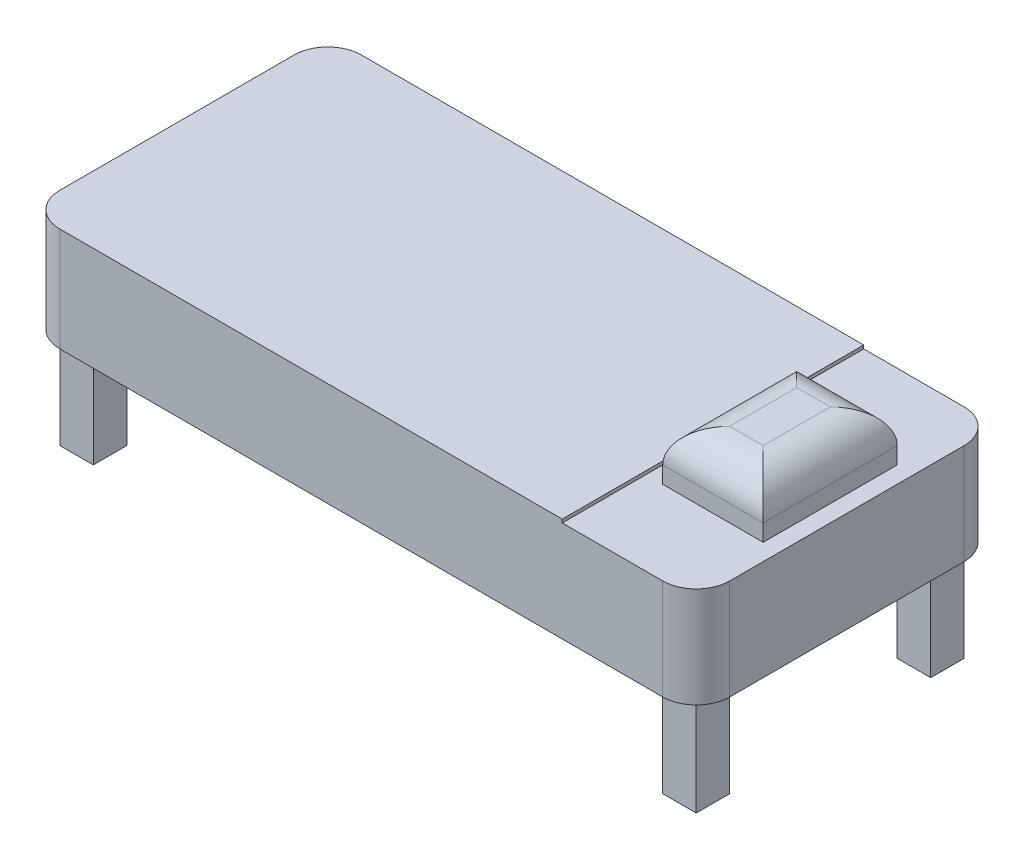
ISO-10303-21;
HEADER;
FILE_DESCRIPTION(('STEP AP214'),'2;1');
FILE_NAME('part.step','',(''),(''),'','','');
FILE_SCHEMA(('AUTOMOTIVE_DESIGN { 1 0 10303 214 1 1 1 1 }'));
ENDSEC;
DATA;
#1=APPLICATION_CONTEXT('core data for automotive mechanical design processes');
#2=APPLICATION_PROTOCOL_DEFINITION('international standard','automotive_design',2000,#1);
#3=PRODUCT_CONTEXT('',#1,'mechanical');
#4=PRODUCT('Part','Part','',(#3));
#5=PRODUCT_RELATED_PRODUCT_CATEGORY('part','',(#4));
#6=PRODUCT_DEFINITION_FORMATION('','',#4);
#7=PRODUCT_DEFINITION_CONTEXT('part definition',#1,'design');
#8=PRODUCT_DEFINITION('design','',#6,#7);
#9=PRODUCT_DEFINITION_SHAPE('','',#8);
#10=(LENGTH_UNIT() NAMED_UNIT(*) SI_UNIT(.MILLI.,.METRE.));
#11=(NAMED_UNIT(*) PLANE_ANGLE_UNIT() SI_UNIT($,.RADIAN.));
#12=(NAMED_UNIT(*) SI_UNIT($,.STERADIAN.) SOLID_ANGLE_UNIT());
#13=UNCERTAINTY_MEASURE_WITH_UNIT(LENGTH_MEASURE(1.E-05),#10,'distance_accuracy_value','');
#14=(GEOMETRIC_REPRESENTATION_CONTEXT(3) GLOBAL_UNCERTAINTY_ASSIGNED_CONTEXT((#13)) GLOBAL_UNIT_ASSIGNED_CONTEXT((#10,
#11,#12)) REPRESENTATION_CONTEXT('',''));
#15=CARTESIAN_POINT('',(0.,0.,0.));
#16=DIRECTION('',(0.,0.,1.));
#17=DIRECTION('',(1.,0.,0.));
#18=AXIS2_PLACEMENT_3D('',#15,#16,#17);
#19=CARTESIAN_POINT('',(0.,300.,0.));
#20=DIRECTION('',(0.,1.,0.));
#21=DIRECTION('',(0.,0.,1.));
#22=AXIS2_PLACEMENT_3D('',#19,#20,#21);
#23=PLANE('',#22);
#24=DIRECTION('',(0.,0.,-1.));
#25=VECTOR('',#24,1.);
#26=CARTESIAN_POINT('',(1000.,300.,450.));
#27=LINE('',#26,#25);
#28=CARTESIAN_POINT('',(1000.,300.,350.));
#29=VERTEX_POINT('',#28);
#30=CARTESIAN_POINT('',(1000.,300.,-350.));
#31=VERTEX_POINT('',#30);
#32=EDGE_CURVE('E338',#29,#31,#27,.T.);
#33=ORIENTED_EDGE('',*,*,#32,.T.);
#34=CARTESIAN_POINT('',(900.,300.,-350.));
#35=DIRECTION('',(0.,1.,0.));
#36=DIRECTION('',(0.,0.,1.));
#37=AXIS2_PLACEMENT_3D('',#34,#35,#36);
#38=CIRCLE('',#37,100.);
#39=CARTESIAN_POINT('',(900.,300.,-450.));
#40=VERTEX_POINT('',#39);
#41=EDGE_CURVE('E364',#31,#40,#38,.T.);
#42=ORIENTED_EDGE('',*,*,#41,.T.);
#43=DIRECTION('',(-1.,0.,0.));
#44=VECTOR('',#43,1.);
#45=CARTESIAN_POINT('',(1000.,300.,-450.));
#46=LINE('',#45,#44);
#47=CARTESIAN_POINT('',(600.,300.,-450.));
#48=VERTEX_POINT('',#47);
#49=EDGE_CURVE('E311',#40,#48,#46,.T.);
#50=ORIENTED_EDGE('',*,*,#49,.T.);
#51=DIRECTION('',(0.,0.,-1.));
#52=VECTOR('',#51,1.);
#53=CARTESIAN_POINT('',(600.,300.,-450.));
#54=LINE('',#53,#52);
#55=CARTESIAN_POINT('',(600.,300.,450.));
#56=VERTEX_POINT('',#55);
#57=EDGE_CURVE('E254',#56,#48,#54,.T.);
#58=ORIENTED_EDGE('',*,*,#57,.F.);
#59=DIRECTION('',(1.,0.,0.));
#60=VECTOR('',#59,1.);
#61=CARTESIAN_POINT('',(1000.,300.,450.));
#62=LINE('',#61,#60);
#63=CARTESIAN_POINT('',(900.,300.,450.));
#64=VERTEX_POINT('',#63);
#65=EDGE_CURVE('E295',#56,#64,#62,.T.);
#66=ORIENTED_EDGE('',*,*,#65,.T.);
#67=CARTESIAN_POINT('',(900.,300.,350.));
#68=DIRECTION('',(0.,1.,0.));
#69=DIRECTION('',(0.,0.,1.));
#70=AXIS2_PLACEMENT_3D('',#67,#68,#69);
#71=CIRCLE('',#70,100.);
#72=EDGE_CURVE('E366',#64,#29,#71,.T.);
#73=ORIENTED_EDGE('',*,*,#72,.T.);
#74=EDGE_LOOP('',(#33,#42,#50,#58,#66,#73));
#75=FACE_BOUND('',#74,.T.);
#76=DIRECTION('',(1.,0.,0.));
#77=VECTOR('',#76,1.);
#78=CARTESIAN_POINT('',(650.,300.,200.));
#79=LINE('',#78,#77);
#80=CARTESIAN_POINT('',(650.,300.,200.));
#81=VERTEX_POINT('',#80);
#82=CARTESIAN_POINT('',(950.,300.,200.));
#83=VERTEX_POINT('',#82);
#84=EDGE_CURVE('E248',#81,#83,#79,.T.);
#85=ORIENTED_EDGE('',*,*,#84,.F.);
#86=DIRECTION('',(0.,0.,1.));
#87=VECTOR('',#86,1.);
#88=CARTESIAN_POINT('',(650.,300.,-200.));
#89=LINE('',#88,#87);
#90=CARTESIAN_POINT('',(650.,300.,-200.));
#91=VERTEX_POINT('',#90);
#92=EDGE_CURVE('E258',#91,#81,#89,.T.);
#93=ORIENTED_EDGE('',*,*,#92,.F.);
#94=DIRECTION('',(-1.,0.,0.));
#95=VECTOR('',#94,1.);
#96=CARTESIAN_POINT('',(650.,300.,-200.));
#97=LINE('',#96,#95);
#98=CARTESIAN_POINT('',(950.,300.,-200.));
#99=VERTEX_POINT('',#98);
#100=EDGE_CURVE('E270',#99,#91,#97,.T.);
#101=ORIENTED_EDGE('',*,*,#100,.F.);
#102=DIRECTION('',(0.,0.,-1.));
#103=VECTOR('',#102,1.);
#104=CARTESIAN_POINT('',(950.,300.,-200.));
#105=LINE('',#104,#103);
#106=EDGE_CURVE('E268',#83,#99,#105,.T.);
#107=ORIENTED_EDGE('',*,*,#106,.F.);
#108=EDGE_LOOP('',(#85,#93,#101,#107));
#109=FACE_BOUND('',#108,.T.);
#110=ADVANCED_FACE('F34',(#75,#109),#23,.T.);
#111=CARTESIAN_POINT('',(0.,0.,0.));
#112=DIRECTION('',(0.,1.,0.));
#113=DIRECTION('',(0.,0.,1.));
#114=AXIS2_PLACEMENT_3D('',#111,#112,#113);
#115=PLANE('',#114);
#116=DIRECTION('',(0.,0.,1.));
#117=VECTOR('',#116,1.);
#118=CARTESIAN_POINT('',(-850.,0.,400.));
#119=LINE('',#118,#117);
#120=CARTESIAN_POINT('',(-850.,0.,300.));
#121=VERTEX_POINT('',#120);
#122=CARTESIAN_POINT('',(-850.,0.,400.));
#123=VERTEX_POINT('',#122);
#124=EDGE_CURVE('E567',#121,#123,#119,.T.);
#125=ORIENTED_EDGE('',*,*,#124,.F.);
#126=DIRECTION('',(1.,0.,0.));
#127=VECTOR('',#126,1.);
#128=CARTESIAN_POINT('',(-950.,0.,300.));
#129=LINE('',#128,#127);
#130=CARTESIAN_POINT('',(-950.,0.,300.));
#131=VERTEX_POINT('',#130);
#132=EDGE_CURVE('E583',#131,#121,#129,.T.);
#133=ORIENTED_EDGE('',*,*,#132,.F.);
#134=DIRECTION('',(0.,0.,-1.));
#135=VECTOR('',#134,1.);
#136=CARTESIAN_POINT('',(-950.,0.,400.));
#137=LINE('',#136,#135);
#138=CARTESIAN_POINT('',(-950.,0.,400.));
#139=VERTEX_POINT('',#138);
#140=EDGE_CURVE('E566',#139,#131,#137,.T.);
#141=ORIENTED_EDGE('',*,*,#140,.F.);
#142=DIRECTION('',(-1.,0.,0.));
#143=VECTOR('',#142,1.);
#144=CARTESIAN_POINT('',(-950.,0.,400.));
#145=LINE('',#144,#143);
#146=EDGE_CURVE('E560',#123,#139,#145,.T.);
#147=ORIENTED_EDGE('',*,*,#146,.F.);
#148=EDGE_LOOP('',(#125,#133,#141,#147));
#149=FACE_BOUND('',#148,.T.);
#150=DIRECTION('',(-1.,0.,0.));
#151=VECTOR('',#150,1.);
#152=CARTESIAN_POINT('',(1000.,0.,-450.));
#153=LINE('',#152,#151);
#154=CARTESIAN_POINT('',(900.,0.,-450.));
#155=VERTEX_POINT('',#154);
#156=CARTESIAN_POINT('',(-900.,0.,-450.));
#157=VERTEX_POINT('',#156);
#158=EDGE_CURVE('E351',#155,#157,#153,.T.);
#159=ORIENTED_EDGE('',*,*,#158,.F.);
#160=CARTESIAN_POINT('',(900.,0.,-350.));
#161=DIRECTION('',(0.,1.,0.));
#162=DIRECTION('',(0.,0.,1.));
#163=AXIS2_PLACEMENT_3D('',#160,#161,#162);
#164=CIRCLE('',#163,100.);
#165=CARTESIAN_POINT('',(1000.,0.,-350.));
#166=VERTEX_POINT('',#165);
#167=EDGE_CURVE('E402',#155,#166,#164,.F.);
#168=ORIENTED_EDGE('',*,*,#167,.T.);
#169=DIRECTION('',(0.,0.,-1.));
#170=VECTOR('',#169,1.);
#171=CARTESIAN_POINT('',(1000.,0.,450.));
#172=LINE('',#171,#170);
#173=CARTESIAN_POINT('',(1000.,0.,350.));
#174=VERTEX_POINT('',#173);
#175=EDGE_CURVE('E349',#174,#166,#172,.T.);
#176=ORIENTED_EDGE('',*,*,#175,.F.);
#177=CARTESIAN_POINT('',(900.,0.,350.));
#178=DIRECTION('',(0.,1.,0.));
#179=DIRECTION('',(0.,0.,1.));
#180=AXIS2_PLACEMENT_3D('',#177,#178,#179);
#181=CIRCLE('',#180,100.);
#182=CARTESIAN_POINT('',(900.,0.,450.));
#183=VERTEX_POINT('',#182);
#184=EDGE_CURVE('E400',#174,#183,#181,.F.);
#185=ORIENTED_EDGE('',*,*,#184,.T.);
#186=DIRECTION('',(1.,0.,0.));
#187=VECTOR('',#186,1.);
#188=CARTESIAN_POINT('',(1000.,0.,450.));
#189=LINE('',#188,#187);
#190=CARTESIAN_POINT('',(-900.,0.,450.));
#191=VERTEX_POINT('',#190);
#192=EDGE_CURVE('E345',#191,#183,#189,.T.);
#193=ORIENTED_EDGE('',*,*,#192,.F.);
#194=CARTESIAN_POINT('',(-900.,0.,350.));
#195=DIRECTION('',(0.,1.,0.));
#196=DIRECTION('',(0.,0.,1.));
#197=AXIS2_PLACEMENT_3D('',#194,#195,#196);
#198=CIRCLE('',#197,100.);
#199=CARTESIAN_POINT('',(-1000.,0.,350.));
#200=VERTEX_POINT('',#199);
#201=EDGE_CURVE('E397',#191,#200,#198,.F.);
#202=ORIENTED_EDGE('',*,*,#201,.T.);
#203=DIRECTION('',(0.,0.,1.));
#204=VECTOR('',#203,1.);
#205=CARTESIAN_POINT('',(-1000.,0.,450.));
#206=LINE('',#205,#204);
#207=CARTESIAN_POINT('',(-1000.,0.,-350.));
#208=VERTEX_POINT('',#207);
#209=EDGE_CURVE('E343',#208,#200,#206,.T.);
#210=ORIENTED_EDGE('',*,*,#209,.F.);
#211=CARTESIAN_POINT('',(-900.,0.,-350.));
#212=DIRECTION('',(0.,1.,0.));
#213=DIRECTION('',(0.,0.,1.));
#214=AXIS2_PLACEMENT_3D('',#211,#212,#213);
#215=CIRCLE('',#214,100.);
#216=EDGE_CURVE('E395',#208,#157,#215,.F.);
#217=ORIENTED_EDGE('',*,*,#216,.T.);
#218=EDGE_LOOP('',(#159,#168,#176,#185,#193,#202,#210,#217));
#219=FACE_BOUND('',#218,.T.);
#220=DIRECTION('',(1.,0.,0.));
#221=VECTOR('',#220,1.);
#222=CARTESIAN_POINT('',(-950.,0.,-300.));
#223=LINE('',#222,#221);
#224=CARTESIAN_POINT('',(-950.,0.,-300.));
#225=VERTEX_POINT('',#224);
#226=CARTESIAN_POINT('',(-850.,0.,-300.));
#227=VERTEX_POINT('',#226);
#228=EDGE_CURVE('E612',#225,#227,#223,.T.);
#229=ORIENTED_EDGE('',*,*,#228,.T.);
#230=DIRECTION('',(0.,0.,-1.));
#231=VECTOR('',#230,1.);
#232=CARTESIAN_POINT('',(-850.,0.,-400.));
#233=LINE('',#232,#231);
#234=CARTESIAN_POINT('',(-850.,0.,-400.));
#235=VERTEX_POINT('',#234);
#236=EDGE_CURVE('E615',#227,#235,#233,.T.);
#237=ORIENTED_EDGE('',*,*,#236,.T.);
#238=DIRECTION('',(-1.,0.,0.));
#239=VECTOR('',#238,1.);
#240=CARTESIAN_POINT('',(-950.,0.,-400.));
#241=LINE('',#240,#239);
#242=CARTESIAN_POINT('',(-950.,0.,-400.));
#243=VERTEX_POINT('',#242);
#244=EDGE_CURVE('E605',#235,#243,#241,.T.);
#245=ORIENTED_EDGE('',*,*,#244,.T.);
#246=DIRECTION('',(0.,0.,1.));
#247=VECTOR('',#246,1.);
#248=CARTESIAN_POINT('',(-950.,0.,-400.));
#249=LINE('',#248,#247);
#250=EDGE_CURVE('E609',#243,#225,#249,.T.);
#251=ORIENTED_EDGE('',*,*,#250,.T.);
#252=EDGE_LOOP('',(#229,#237,#245,#251));
#253=FACE_BOUND('',#252,.T.);
#254=DIRECTION('',(-1.,0.,0.));
#255=VECTOR('',#254,1.);
#256=CARTESIAN_POINT('',(950.,0.,300.));
#257=LINE('',#256,#255);
#258=CARTESIAN_POINT('',(950.,0.,300.));
#259=VERTEX_POINT('',#258);
#260=CARTESIAN_POINT('',(850.,0.,300.));
#261=VERTEX_POINT('',#260);
#262=EDGE_CURVE('E645',#259,#261,#257,.T.);
#263=ORIENTED_EDGE('',*,*,#262,.T.);
#264=DIRECTION('',(0.,0.,1.));
#265=VECTOR('',#264,1.);
#266=CARTESIAN_POINT('',(850.,0.,400.));
#267=LINE('',#266,#265);
#268=CARTESIAN_POINT('',(850.,0.,400.));
#269=VERTEX_POINT('',#268);
#270=EDGE_CURVE('E648',#261,#269,#267,.T.);
#271=ORIENTED_EDGE('',*,*,#270,.T.);
#272=DIRECTION('',(1.,0.,0.));
#273=VECTOR('',#272,1.);
#274=CARTESIAN_POINT('',(950.,0.,400.));
#275=LINE('',#274,#273);
#276=CARTESIAN_POINT('',(950.,0.,400.));
#277=VERTEX_POINT('',#276);
#278=EDGE_CURVE('E638',#269,#277,#275,.T.);
#279=ORIENTED_EDGE('',*,*,#278,.T.);
#280=DIRECTION('',(0.,0.,-1.));
#281=VECTOR('',#280,1.);
#282=CARTESIAN_POINT('',(950.,0.,400.));
#283=LINE('',#282,#281);
#284=EDGE_CURVE('E642',#277,#259,#283,.T.);
#285=ORIENTED_EDGE('',*,*,#284,.T.);
#286=EDGE_LOOP('',(#263,#271,#279,#285));
#287=FACE_BOUND('',#286,.T.);
#288=DIRECTION('',(0.,0.,-1.));
#289=VECTOR('',#288,1.);
#290=CARTESIAN_POINT('',(850.,0.,-400.));
#291=LINE('',#290,#289);
#292=CARTESIAN_POINT('',(850.,0.,-300.));
#293=VERTEX_POINT('',#292);
#294=CARTESIAN_POINT('',(850.,0.,-400.));
#295=VERTEX_POINT('',#294);
#296=EDGE_CURVE('E305',#293,#295,#291,.T.);
#297=ORIENTED_EDGE('',*,*,#296,.F.);
#298=DIRECTION('',(-1.,0.,0.));
#299=VECTOR('',#298,1.);
#300=CARTESIAN_POINT('',(950.,0.,-300.));
#301=LINE('',#300,#299);
#302=CARTESIAN_POINT('',(950.,0.,-300.));
#303=VERTEX_POINT('',#302);
#304=EDGE_CURVE('E674',#303,#293,#301,.T.);
#305=ORIENTED_EDGE('',*,*,#304,.F.);
#306=DIRECTION('',(0.,0.,1.));
#307=VECTOR('',#306,1.);
#308=CARTESIAN_POINT('',(950.,0.,-400.));
#309=LINE('',#308,#307);
#310=CARTESIAN_POINT('',(950.,0.,-400.));
#311=VERTEX_POINT('',#310);
#312=EDGE_CURVE('E677',#311,#303,#309,.T.);
#313=ORIENTED_EDGE('',*,*,#312,.F.);
#314=DIRECTION('',(1.,0.,0.));
#315=VECTOR('',#314,1.);
#316=CARTESIAN_POINT('',(950.,0.,-400.));
#317=LINE('',#316,#315);
#318=EDGE_CURVE('E680',#295,#311,#317,.T.);
#319=ORIENTED_EDGE('',*,*,#318,.F.);
#320=EDGE_LOOP('',(#297,#305,#313,#319));
#321=FACE_BOUND('',#320,.T.);
#322=ADVANCED_FACE('F393',(#149,#219,#253,#287,#321),#115,.F.);
#323=CARTESIAN_POINT('',(-1000.,300.,450.));
#324=DIRECTION('',(1.,0.,0.));
#325=DIRECTION('',(0.,0.,-1.));
#326=AXIS2_PLACEMENT_3D('',#323,#324,#325);
#327=PLANE('',#326);
#328=ORIENTED_EDGE('',*,*,#209,.T.);
#329=DIRECTION('',(0.,-1.,0.));
#330=VECTOR('',#329,1.);
#331=CARTESIAN_POINT('',(-1000.,300.,350.));
#332=LINE('',#331,#330);
#333=CARTESIAN_POINT('',(-1000.,310.,350.));
#334=VERTEX_POINT('',#333);
#335=EDGE_CURVE('E49',#200,#334,#332,.F.);
#336=ORIENTED_EDGE('',*,*,#335,.T.);
#337=DIRECTION('',(0.,0.,1.));
#338=VECTOR('',#337,1.);
#339=CARTESIAN_POINT('',(-1000.,310.,-450.));
#340=LINE('',#339,#338);
#341=CARTESIAN_POINT('',(-1000.,310.,-350.));
#342=VERTEX_POINT('',#341);
#343=EDGE_CURVE('E278',#342,#334,#340,.T.);
#344=ORIENTED_EDGE('',*,*,#343,.F.);
#345=DIRECTION('',(0.,-1.,0.));
#346=VECTOR('',#345,1.);
#347=CARTESIAN_POINT('',(-1000.,300.,-350.));
#348=LINE('',#347,#346);
#349=EDGE_CURVE('E385',#342,#208,#348,.T.);
#350=ORIENTED_EDGE('',*,*,#349,.T.);
#351=EDGE_LOOP('',(#328,#336,#344,#350));
#352=FACE_BOUND('',#351,.T.);
#353=ADVANCED_FACE('F390',(#352),#327,.F.);
#354=CARTESIAN_POINT('',(1000.,300.,450.));
#355=DIRECTION('',(0.,0.,-1.));
#356=DIRECTION('',(-1.,0.,0.));
#357=AXIS2_PLACEMENT_3D('',#354,#355,#356);
#358=PLANE('',#357);
#359=ORIENTED_EDGE('',*,*,#192,.T.);
#360=DIRECTION('',(0.,-1.,0.));
#361=VECTOR('',#360,1.);
#362=CARTESIAN_POINT('',(900.,300.,450.));
#363=LINE('',#362,#361);
#364=EDGE_CURVE('E379',#183,#64,#363,.F.);
#365=ORIENTED_EDGE('',*,*,#364,.T.);
#366=ORIENTED_EDGE('',*,*,#65,.F.);
#367=DIRECTION('',(0.,-1.,0.));
#368=VECTOR('',#367,1.);
#369=CARTESIAN_POINT('',(600.,310.,450.));
#370=LINE('',#369,#368);
#371=CARTESIAN_POINT('',(600.,310.,450.));
#372=VERTEX_POINT('',#371);
#373=EDGE_CURVE('E300',#372,#56,#370,.T.);
#374=ORIENTED_EDGE('',*,*,#373,.F.);
#375=DIRECTION('',(1.,0.,0.));
#376=VECTOR('',#375,1.);
#377=CARTESIAN_POINT('',(-1000.,310.,450.));
#378=LINE('',#377,#376);
#379=CARTESIAN_POINT('',(-900.,310.,450.));
#380=VERTEX_POINT('',#379);
#381=EDGE_CURVE('E280',#380,#372,#378,.T.);
#382=ORIENTED_EDGE('',*,*,#381,.F.);
#383=DIRECTION('',(0.,-1.,0.));
#384=VECTOR('',#383,1.);
#385=CARTESIAN_POINT('',(-900.,300.,450.));
#386=LINE('',#385,#384);
#387=EDGE_CURVE('E376',#380,#191,#386,.T.);
#388=ORIENTED_EDGE('',*,*,#387,.T.);
#389=EDGE_LOOP('',(#359,#365,#366,#374,#382,#388));
#390=FACE_BOUND('',#389,.T.);
#391=ADVANCED_FACE('F436',(#390),#358,.F.);
#392=CARTESIAN_POINT('',(1000.,300.,450.));
#393=DIRECTION('',(-1.,0.,0.));
#394=DIRECTION('',(0.,0.,1.));
#395=AXIS2_PLACEMENT_3D('',#392,#393,#394);
#396=PLANE('',#395);
#397=ORIENTED_EDGE('',*,*,#175,.T.);
#398=DIRECTION('',(0.,-1.,0.));
#399=VECTOR('',#398,1.);
#400=CARTESIAN_POINT('',(1000.,300.,-350.));
#401=LINE('',#400,#399);
#402=EDGE_CURVE('E374',#166,#31,#401,.F.);
#403=ORIENTED_EDGE('',*,*,#402,.T.);
#404=ORIENTED_EDGE('',*,*,#32,.F.);
#405=DIRECTION('',(0.,-1.,0.));
#406=VECTOR('',#405,1.);
#407=CARTESIAN_POINT('',(1000.,300.,350.));
#408=LINE('',#407,#406);
#409=EDGE_CURVE('E407',#29,#174,#408,.T.);
#410=ORIENTED_EDGE('',*,*,#409,.T.);
#411=EDGE_LOOP('',(#397,#403,#404,#410));
#412=FACE_BOUND('',#411,.T.);
#413=ADVANCED_FACE('F408',(#412),#396,.F.);
#414=CARTESIAN_POINT('',(1000.,300.,-450.));
#415=DIRECTION('',(0.,0.,1.));
#416=DIRECTION('',(1.,0.,0.));
#417=AXIS2_PLACEMENT_3D('',#414,#415,#416);
#418=PLANE('',#417);
#419=ORIENTED_EDGE('',*,*,#49,.F.);
#420=DIRECTION('',(0.,-1.,0.));
#421=VECTOR('',#420,1.);
#422=CARTESIAN_POINT('',(900.,300.,-450.));
#423=LINE('',#422,#421);
#424=EDGE_CURVE('E375',#40,#155,#423,.T.);
#425=ORIENTED_EDGE('',*,*,#424,.T.);
#426=ORIENTED_EDGE('',*,*,#158,.T.);
#427=DIRECTION('',(0.,-1.,0.));
#428=VECTOR('',#427,1.);
#429=CARTESIAN_POINT('',(-900.,300.,-450.));
#430=LINE('',#429,#428);
#431=CARTESIAN_POINT('',(-900.,310.,-450.));
#432=VERTEX_POINT('',#431);
#433=EDGE_CURVE('E326',#157,#432,#430,.F.);
#434=ORIENTED_EDGE('',*,*,#433,.T.);
#435=DIRECTION('',(-1.,0.,0.));
#436=VECTOR('',#435,1.);
#437=CARTESIAN_POINT('',(-1000.,310.,-450.));
#438=LINE('',#437,#436);
#439=CARTESIAN_POINT('',(600.,310.,-450.));
#440=VERTEX_POINT('',#439);
#441=EDGE_CURVE('E284',#440,#432,#438,.T.);
#442=ORIENTED_EDGE('',*,*,#441,.F.);
#443=DIRECTION('',(0.,-1.,0.));
#444=VECTOR('',#443,1.);
#445=CARTESIAN_POINT('',(600.,310.,-450.));
#446=LINE('',#445,#444);
#447=EDGE_CURVE('E286',#440,#48,#446,.T.);
#448=ORIENTED_EDGE('',*,*,#447,.T.);
#449=EDGE_LOOP('',(#419,#425,#426,#434,#442,#448));
#450=FACE_BOUND('',#449,.T.);
#451=ADVANCED_FACE('F410',(#450),#418,.F.);
#452=CARTESIAN_POINT('',(-850.,-300.,400.));
#453=DIRECTION('',(-1.,0.,0.));
#454=DIRECTION('',(0.,0.,1.));
#455=AXIS2_PLACEMENT_3D('',#452,#453,#454);
#456=PLANE('',#455);
#457=ORIENTED_EDGE('',*,*,#124,.T.);
#458=DIRECTION('',(0.,1.,0.));
#459=VECTOR('',#458,1.);
#460=CARTESIAN_POINT('',(-850.,-300.,400.));
#461=LINE('',#460,#459);
#462=CARTESIAN_POINT('',(-850.,-300.,400.));
#463=VERTEX_POINT('',#462);
#464=EDGE_CURVE('E346',#463,#123,#461,.T.);
#465=ORIENTED_EDGE('',*,*,#464,.F.);
#466=DIRECTION('',(0.,0.,1.));
#467=VECTOR('',#466,1.);
#468=CARTESIAN_POINT('',(-850.,-300.,400.));
#469=LINE('',#468,#467);
#470=CARTESIAN_POINT('',(-850.,-300.,300.));
#471=VERTEX_POINT('',#470);
#472=EDGE_CURVE('E586',#471,#463,#469,.T.);
#473=ORIENTED_EDGE('',*,*,#472,.F.);
#474=DIRECTION('',(0.,1.,0.));
#475=VECTOR('',#474,1.);
#476=CARTESIAN_POINT('',(-850.,-300.,300.));
#477=LINE('',#476,#475);
#478=EDGE_CURVE('E576',#471,#121,#477,.T.);
#479=ORIENTED_EDGE('',*,*,#478,.T.);
#480=EDGE_LOOP('',(#457,#465,#473,#479));
#481=FACE_BOUND('',#480,.T.);
#482=ADVANCED_FACE('F429',(#481),#456,.F.);
#483=CARTESIAN_POINT('',(-950.,-300.,400.));
#484=DIRECTION('',(0.,0.,-1.));
#485=DIRECTION('',(-1.,0.,0.));
#486=AXIS2_PLACEMENT_3D('',#483,#484,#485);
#487=PLANE('',#486);
#488=ORIENTED_EDGE('',*,*,#146,.T.);
#489=DIRECTION('',(0.,1.,0.));
#490=VECTOR('',#489,1.);
#491=CARTESIAN_POINT('',(-950.,-300.,400.));
#492=LINE('',#491,#490);
#493=CARTESIAN_POINT('',(-950.,-300.,400.));
#494=VERTEX_POINT('',#493);
#495=EDGE_CURVE('E562',#494,#139,#492,.T.);
#496=ORIENTED_EDGE('',*,*,#495,.F.);
#497=DIRECTION('',(-1.,0.,0.));
#498=VECTOR('',#497,1.);
#499=CARTESIAN_POINT('',(-950.,-300.,400.));
#500=LINE('',#499,#498);
#501=EDGE_CURVE('E592',#463,#494,#500,.T.);
#502=ORIENTED_EDGE('',*,*,#501,.F.);
#503=ORIENTED_EDGE('',*,*,#464,.T.);
#504=EDGE_LOOP('',(#488,#496,#502,#503));
#505=FACE_BOUND('',#504,.T.);
#506=ADVANCED_FACE('F549',(#505),#487,.F.);
#507=CARTESIAN_POINT('',(-950.,-300.,400.));
#508=DIRECTION('',(1.,0.,0.));
#509=DIRECTION('',(0.,0.,-1.));
#510=AXIS2_PLACEMENT_3D('',#507,#508,#509);
#511=PLANE('',#510);
#512=ORIENTED_EDGE('',*,*,#140,.T.);
#513=DIRECTION('',(0.,1.,0.));
#514=VECTOR('',#513,1.);
#515=CARTESIAN_POINT('',(-950.,-300.,300.));
#516=LINE('',#515,#514);
#517=CARTESIAN_POINT('',(-950.,-300.,300.));
#518=VERTEX_POINT('',#517);
#519=EDGE_CURVE('E573',#518,#131,#516,.T.);
#520=ORIENTED_EDGE('',*,*,#519,.F.);
#521=DIRECTION('',(0.,0.,-1.));
#522=VECTOR('',#521,1.);
#523=CARTESIAN_POINT('',(-950.,-300.,400.));
#524=LINE('',#523,#522);
#525=EDGE_CURVE('E572',#494,#518,#524,.T.);
#526=ORIENTED_EDGE('',*,*,#525,.F.);
#527=ORIENTED_EDGE('',*,*,#495,.T.);
#528=EDGE_LOOP('',(#512,#520,#526,#527));
#529=FACE_BOUND('',#528,.T.);
#530=ADVANCED_FACE('F546',(#529),#511,.F.);
#531=CARTESIAN_POINT('',(-950.,-300.,300.));
#532=DIRECTION('',(0.,0.,1.));
#533=DIRECTION('',(1.,0.,0.));
#534=AXIS2_PLACEMENT_3D('',#531,#532,#533);
#535=PLANE('',#534);
#536=ORIENTED_EDGE('',*,*,#132,.T.);
#537=ORIENTED_EDGE('',*,*,#478,.F.);
#538=DIRECTION('',(1.,0.,0.));
#539=VECTOR('',#538,1.);
#540=CARTESIAN_POINT('',(-950.,-300.,300.));
#541=LINE('',#540,#539);
#542=EDGE_CURVE('E582',#518,#471,#541,.T.);
#543=ORIENTED_EDGE('',*,*,#542,.F.);
#544=ORIENTED_EDGE('',*,*,#519,.T.);
#545=EDGE_LOOP('',(#536,#537,#543,#544));
#546=FACE_BOUND('',#545,.T.);
#547=ADVANCED_FACE('F542',(#546),#535,.F.);
#548=CARTESIAN_POINT('',(0.,-300.,0.));
#549=DIRECTION('',(0.,-1.,0.));
#550=DIRECTION('',(0.,0.,-1.));
#551=AXIS2_PLACEMENT_3D('',#548,#549,#550);
#552=PLANE('',#551);
#553=ORIENTED_EDGE('',*,*,#472,.T.);
#554=ORIENTED_EDGE('',*,*,#501,.T.);
#555=ORIENTED_EDGE('',*,*,#525,.T.);
#556=ORIENTED_EDGE('',*,*,#542,.T.);
#557=EDGE_LOOP('',(#553,#554,#555,#556));
#558=FACE_BOUND('',#557,.T.);
#559=ADVANCED_FACE('F538',(#558),#552,.T.);
#560=CARTESIAN_POINT('',(-850.,-300.,-400.));
#561=DIRECTION('',(1.,0.,0.));
#562=DIRECTION('',(0.,0.,-1.));
#563=AXIS2_PLACEMENT_3D('',#560,#561,#562);
#564=PLANE('',#563);
#565=ORIENTED_EDGE('',*,*,#236,.F.);
#566=DIRECTION('',(0.,1.,0.));
#567=VECTOR('',#566,1.);
#568=CARTESIAN_POINT('',(-850.,-300.,-300.));
#569=LINE('',#568,#567);
#570=CARTESIAN_POINT('',(-850.,-300.,-300.));
#571=VERTEX_POINT('',#570);
#572=EDGE_CURVE('E589',#571,#227,#569,.T.);
#573=ORIENTED_EDGE('',*,*,#572,.F.);
#574=DIRECTION('',(0.,0.,-1.));
#575=VECTOR('',#574,1.);
#576=CARTESIAN_POINT('',(-850.,-300.,-400.));
#577=LINE('',#576,#575);
#578=CARTESIAN_POINT('',(-850.,-300.,-400.));
#579=VERTEX_POINT('',#578);
#580=EDGE_CURVE('E608',#571,#579,#577,.T.);
#581=ORIENTED_EDGE('',*,*,#580,.T.);
#582=DIRECTION('',(0.,1.,0.));
#583=VECTOR('',#582,1.);
#584=CARTESIAN_POINT('',(-850.,-300.,-400.));
#585=LINE('',#584,#583);
#586=EDGE_CURVE('E602',#579,#235,#585,.T.);
#587=ORIENTED_EDGE('',*,*,#586,.T.);
#588=EDGE_LOOP('',(#565,#573,#581,#587));
#589=FACE_BOUND('',#588,.T.);
#590=ADVANCED_FACE('F534',(#589),#564,.T.);
#591=CARTESIAN_POINT('',(-950.,-300.,-300.));
#592=DIRECTION('',(0.,0.,1.));
#593=DIRECTION('',(1.,0.,0.));
#594=AXIS2_PLACEMENT_3D('',#591,#592,#593);
#595=PLANE('',#594);
#596=ORIENTED_EDGE('',*,*,#228,.F.);
#597=DIRECTION('',(0.,1.,0.));
#598=VECTOR('',#597,1.);
#599=CARTESIAN_POINT('',(-950.,-300.,-300.));
#600=LINE('',#599,#598);
#601=CARTESIAN_POINT('',(-950.,-300.,-300.));
#602=VERTEX_POINT('',#601);
#603=EDGE_CURVE('E597',#602,#225,#600,.T.);
#604=ORIENTED_EDGE('',*,*,#603,.F.);
#605=DIRECTION('',(1.,0.,0.));
#606=VECTOR('',#605,1.);
#607=CARTESIAN_POINT('',(-950.,-300.,-300.));
#608=LINE('',#607,#606);
#609=EDGE_CURVE('E624',#602,#571,#608,.T.);
#610=ORIENTED_EDGE('',*,*,#609,.T.);
#611=ORIENTED_EDGE('',*,*,#572,.T.);
#612=EDGE_LOOP('',(#596,#604,#610,#611));
#613=FACE_BOUND('',#612,.T.);
#614=ADVANCED_FACE('F530',(#613),#595,.T.);
#615=CARTESIAN_POINT('',(-950.,-300.,-400.));
#616=DIRECTION('',(-1.,0.,0.));
#617=DIRECTION('',(0.,0.,1.));
#618=AXIS2_PLACEMENT_3D('',#615,#616,#617);
#619=PLANE('',#618);
#620=ORIENTED_EDGE('',*,*,#250,.F.);
#621=DIRECTION('',(0.,1.,0.));
#622=VECTOR('',#621,1.);
#623=CARTESIAN_POINT('',(-950.,-300.,-400.));
#624=LINE('',#623,#622);
#625=CARTESIAN_POINT('',(-950.,-300.,-400.));
#626=VERTEX_POINT('',#625);
#627=EDGE_CURVE('E599',#626,#243,#624,.T.);
#628=ORIENTED_EDGE('',*,*,#627,.F.);
#629=DIRECTION('',(0.,0.,1.));
#630=VECTOR('',#629,1.);
#631=CARTESIAN_POINT('',(-950.,-300.,-400.));
#632=LINE('',#631,#630);
#633=EDGE_CURVE('E621',#626,#602,#632,.T.);
#634=ORIENTED_EDGE('',*,*,#633,.T.);
#635=ORIENTED_EDGE('',*,*,#603,.T.);
#636=EDGE_LOOP('',(#620,#628,#634,#635));
#637=FACE_BOUND('',#636,.T.);
#638=ADVANCED_FACE('F526',(#637),#619,.T.);
#639=CARTESIAN_POINT('',(-950.,-300.,-400.));
#640=DIRECTION('',(0.,0.,-1.));
#641=DIRECTION('',(-1.,0.,0.));
#642=AXIS2_PLACEMENT_3D('',#639,#640,#641);
#643=PLANE('',#642);
#644=ORIENTED_EDGE('',*,*,#244,.F.);
#645=ORIENTED_EDGE('',*,*,#586,.F.);
#646=DIRECTION('',(-1.,0.,0.));
#647=VECTOR('',#646,1.);
#648=CARTESIAN_POINT('',(-950.,-300.,-400.));
#649=LINE('',#648,#647);
#650=EDGE_CURVE('E604',#579,#626,#649,.T.);
#651=ORIENTED_EDGE('',*,*,#650,.T.);
#652=ORIENTED_EDGE('',*,*,#627,.T.);
#653=EDGE_LOOP('',(#644,#645,#651,#652));
#654=FACE_BOUND('',#653,.T.);
#655=ADVANCED_FACE('F522',(#654),#643,.T.);
#656=CARTESIAN_POINT('',(0.,-300.,0.));
#657=DIRECTION('',(0.,-1.,0.));
#658=DIRECTION('',(0.,0.,1.));
#659=AXIS2_PLACEMENT_3D('',#656,#657,#658);
#660=PLANE('',#659);
#661=ORIENTED_EDGE('',*,*,#580,.F.);
#662=ORIENTED_EDGE('',*,*,#609,.F.);
#663=ORIENTED_EDGE('',*,*,#633,.F.);
#664=ORIENTED_EDGE('',*,*,#650,.F.);
#665=EDGE_LOOP('',(#661,#662,#663,#664));
#666=FACE_BOUND('',#665,.T.);
#667=ADVANCED_FACE('F518',(#666),#660,.T.);
#668=CARTESIAN_POINT('',(850.,-300.,400.));
#669=DIRECTION('',(-1.,0.,0.));
#670=DIRECTION('',(0.,0.,1.));
#671=AXIS2_PLACEMENT_3D('',#668,#669,#670);
#672=PLANE('',#671);
#673=ORIENTED_EDGE('',*,*,#270,.F.);
#674=DIRECTION('',(0.,1.,0.));
#675=VECTOR('',#674,1.);
#676=CARTESIAN_POINT('',(850.,-300.,300.));
#677=LINE('',#676,#675);
#678=CARTESIAN_POINT('',(850.,-300.,300.));
#679=VERTEX_POINT('',#678);
#680=EDGE_CURVE('E618',#679,#261,#677,.T.);
#681=ORIENTED_EDGE('',*,*,#680,.F.);
#682=DIRECTION('',(0.,0.,1.));
#683=VECTOR('',#682,1.);
#684=CARTESIAN_POINT('',(850.,-300.,400.));
#685=LINE('',#684,#683);
#686=CARTESIAN_POINT('',(850.,-300.,400.));
#687=VERTEX_POINT('',#686);
#688=EDGE_CURVE('E641',#679,#687,#685,.T.);
#689=ORIENTED_EDGE('',*,*,#688,.T.);
#690=DIRECTION('',(0.,1.,0.));
#691=VECTOR('',#690,1.);
#692=CARTESIAN_POINT('',(850.,-300.,400.));
#693=LINE('',#692,#691);
#694=EDGE_CURVE('E635',#687,#269,#693,.T.);
#695=ORIENTED_EDGE('',*,*,#694,.T.);
#696=EDGE_LOOP('',(#673,#681,#689,#695));
#697=FACE_BOUND('',#696,.T.);
#698=ADVANCED_FACE('F514',(#697),#672,.T.);
#699=CARTESIAN_POINT('',(950.,-300.,300.));
#700=DIRECTION('',(0.,0.,-1.));
#701=DIRECTION('',(-1.,0.,0.));
#702=AXIS2_PLACEMENT_3D('',#699,#700,#701);
#703=PLANE('',#702);
#704=ORIENTED_EDGE('',*,*,#262,.F.);
#705=DIRECTION('',(0.,1.,0.));
#706=VECTOR('',#705,1.);
#707=CARTESIAN_POINT('',(950.,-300.,300.));
#708=LINE('',#707,#706);
#709=CARTESIAN_POINT('',(950.,-300.,300.));
#710=VERTEX_POINT('',#709);
#711=EDGE_CURVE('E630',#710,#259,#708,.T.);
#712=ORIENTED_EDGE('',*,*,#711,.F.);
#713=DIRECTION('',(-1.,0.,0.));
#714=VECTOR('',#713,1.);
#715=CARTESIAN_POINT('',(950.,-300.,300.));
#716=LINE('',#715,#714);
#717=EDGE_CURVE('E657',#710,#679,#716,.T.);
#718=ORIENTED_EDGE('',*,*,#717,.T.);
#719=ORIENTED_EDGE('',*,*,#680,.T.);
#720=EDGE_LOOP('',(#704,#712,#718,#719));
#721=FACE_BOUND('',#720,.T.);
#722=ADVANCED_FACE('F510',(#721),#703,.T.);
#723=CARTESIAN_POINT('',(950.,-300.,400.));
#724=DIRECTION('',(1.,0.,0.));
#725=DIRECTION('',(0.,0.,-1.));
#726=AXIS2_PLACEMENT_3D('',#723,#724,#725);
#727=PLANE('',#726);
#728=ORIENTED_EDGE('',*,*,#284,.F.);
#729=DIRECTION('',(0.,1.,0.));
#730=VECTOR('',#729,1.);
#731=CARTESIAN_POINT('',(950.,-300.,400.));
#732=LINE('',#731,#730);
#733=CARTESIAN_POINT('',(950.,-300.,400.));
#734=VERTEX_POINT('',#733);
#735=EDGE_CURVE('E632',#734,#277,#732,.T.);
#736=ORIENTED_EDGE('',*,*,#735,.F.);
#737=DIRECTION('',(0.,0.,-1.));
#738=VECTOR('',#737,1.);
#739=CARTESIAN_POINT('',(950.,-300.,400.));
#740=LINE('',#739,#738);
#741=EDGE_CURVE('E654',#734,#710,#740,.T.);
#742=ORIENTED_EDGE('',*,*,#741,.T.);
#743=ORIENTED_EDGE('',*,*,#711,.T.);
#744=EDGE_LOOP('',(#728,#736,#742,#743));
#745=FACE_BOUND('',#744,.T.);
#746=ADVANCED_FACE('F506',(#745),#727,.T.);
#747=CARTESIAN_POINT('',(950.,-300.,400.));
#748=DIRECTION('',(0.,0.,1.));
#749=DIRECTION('',(1.,0.,0.));
#750=AXIS2_PLACEMENT_3D('',#747,#748,#749);
#751=PLANE('',#750);
#752=ORIENTED_EDGE('',*,*,#278,.F.);
#753=ORIENTED_EDGE('',*,*,#694,.F.);
#754=DIRECTION('',(1.,0.,0.));
#755=VECTOR('',#754,1.);
#756=CARTESIAN_POINT('',(950.,-300.,400.));
#757=LINE('',#756,#755);
#758=EDGE_CURVE('E637',#687,#734,#757,.T.);
#759=ORIENTED_EDGE('',*,*,#758,.T.);
#760=ORIENTED_EDGE('',*,*,#735,.T.);
#761=EDGE_LOOP('',(#752,#753,#759,#760));
#762=FACE_BOUND('',#761,.T.);
#763=ADVANCED_FACE('F502',(#762),#751,.T.);
#764=CARTESIAN_POINT('',(0.,-300.,0.));
#765=DIRECTION('',(0.,-1.,0.));
#766=DIRECTION('',(0.,0.,-1.));
#767=AXIS2_PLACEMENT_3D('',#764,#765,#766);
#768=PLANE('',#767);
#769=ORIENTED_EDGE('',*,*,#688,.F.);
#770=ORIENTED_EDGE('',*,*,#717,.F.);
#771=ORIENTED_EDGE('',*,*,#741,.F.);
#772=ORIENTED_EDGE('',*,*,#758,.F.);
#773=EDGE_LOOP('',(#769,#770,#771,#772));
#774=FACE_BOUND('',#773,.T.);
#775=ADVANCED_FACE('F498',(#774),#768,.T.);
#776=CARTESIAN_POINT('',(850.,-300.,-400.));
#777=DIRECTION('',(1.,0.,0.));
#778=DIRECTION('',(0.,0.,-1.));
#779=AXIS2_PLACEMENT_3D('',#776,#777,#778);
#780=PLANE('',#779);
#781=ORIENTED_EDGE('',*,*,#296,.T.);
#782=DIRECTION('',(0.,1.,0.));
#783=VECTOR('',#782,1.);
#784=CARTESIAN_POINT('',(850.,-300.,-400.));
#785=LINE('',#784,#783);
#786=CARTESIAN_POINT('',(850.,-300.,-400.));
#787=VERTEX_POINT('',#786);
#788=EDGE_CURVE('E651',#787,#295,#785,.T.);
#789=ORIENTED_EDGE('',*,*,#788,.F.);
#790=DIRECTION('',(0.,0.,-1.));
#791=VECTOR('',#790,1.);
#792=CARTESIAN_POINT('',(850.,-300.,-400.));
#793=LINE('',#792,#791);
#794=CARTESIAN_POINT('',(850.,-300.,-300.));
#795=VERTEX_POINT('',#794);
#796=EDGE_CURVE('E289',#795,#787,#793,.T.);
#797=ORIENTED_EDGE('',*,*,#796,.F.);
#798=DIRECTION('',(0.,1.,0.));
#799=VECTOR('',#798,1.);
#800=CARTESIAN_POINT('',(850.,-300.,-300.));
#801=LINE('',#800,#799);
#802=EDGE_CURVE('E670',#795,#293,#801,.T.);
#803=ORIENTED_EDGE('',*,*,#802,.T.);
#804=EDGE_LOOP('',(#781,#789,#797,#803));
#805=FACE_BOUND('',#804,.T.);
#806=ADVANCED_FACE('F494',(#805),#780,.F.);
#807=CARTESIAN_POINT('',(950.,-300.,-400.));
#808=DIRECTION('',(0.,0.,1.));
#809=DIRECTION('',(1.,0.,0.));
#810=AXIS2_PLACEMENT_3D('',#807,#808,#809);
#811=PLANE('',#810);
#812=ORIENTED_EDGE('',*,*,#318,.T.);
#813=DIRECTION('',(0.,1.,0.));
#814=VECTOR('',#813,1.);
#815=CARTESIAN_POINT('',(950.,-300.,-400.));
#816=LINE('',#815,#814);
#817=CARTESIAN_POINT('',(950.,-300.,-400.));
#818=VERTEX_POINT('',#817);
#819=EDGE_CURVE('E664',#818,#311,#816,.T.);
#820=ORIENTED_EDGE('',*,*,#819,.F.);
#821=DIRECTION('',(1.,0.,0.));
#822=VECTOR('',#821,1.);
#823=CARTESIAN_POINT('',(950.,-300.,-400.));
#824=LINE('',#823,#822);
#825=EDGE_CURVE('E687',#787,#818,#824,.T.);
#826=ORIENTED_EDGE('',*,*,#825,.F.);
#827=ORIENTED_EDGE('',*,*,#788,.T.);
#828=EDGE_LOOP('',(#812,#820,#826,#827));
#829=FACE_BOUND('',#828,.T.);
#830=ADVANCED_FACE('F490',(#829),#811,.F.);
#831=CARTESIAN_POINT('',(950.,-300.,-400.));
#832=DIRECTION('',(-1.,0.,0.));
#833=DIRECTION('',(0.,0.,1.));
#834=AXIS2_PLACEMENT_3D('',#831,#832,#833);
#835=PLANE('',#834);
#836=ORIENTED_EDGE('',*,*,#312,.T.);
#837=DIRECTION('',(0.,1.,0.));
#838=VECTOR('',#837,1.);
#839=CARTESIAN_POINT('',(950.,-300.,-300.));
#840=LINE('',#839,#838);
#841=CARTESIAN_POINT('',(950.,-300.,-300.));
#842=VERTEX_POINT('',#841);
#843=EDGE_CURVE('E667',#842,#303,#840,.T.);
#844=ORIENTED_EDGE('',*,*,#843,.F.);
#845=DIRECTION('',(0.,0.,1.));
#846=VECTOR('',#845,1.);
#847=CARTESIAN_POINT('',(950.,-300.,-400.));
#848=LINE('',#847,#846);
#849=EDGE_CURVE('E686',#818,#842,#848,.T.);
#850=ORIENTED_EDGE('',*,*,#849,.F.);
#851=ORIENTED_EDGE('',*,*,#819,.T.);
#852=EDGE_LOOP('',(#836,#844,#850,#851));
#853=FACE_BOUND('',#852,.T.);
#854=ADVANCED_FACE('F486',(#853),#835,.F.);
#855=CARTESIAN_POINT('',(950.,-300.,-300.));
#856=DIRECTION('',(0.,0.,-1.));
#857=DIRECTION('',(-1.,0.,0.));
#858=AXIS2_PLACEMENT_3D('',#855,#856,#857);
#859=PLANE('',#858);
#860=ORIENTED_EDGE('',*,*,#304,.T.);
#861=ORIENTED_EDGE('',*,*,#802,.F.);
#862=DIRECTION('',(-1.,0.,0.));
#863=VECTOR('',#862,1.);
#864=CARTESIAN_POINT('',(950.,-300.,-300.));
#865=LINE('',#864,#863);
#866=EDGE_CURVE('E673',#842,#795,#865,.T.);
#867=ORIENTED_EDGE('',*,*,#866,.F.);
#868=ORIENTED_EDGE('',*,*,#843,.T.);
#869=EDGE_LOOP('',(#860,#861,#867,#868));
#870=FACE_BOUND('',#869,.T.);
#871=ADVANCED_FACE('F479',(#870),#859,.F.);
#872=CARTESIAN_POINT('',(0.,-300.,0.));
#873=DIRECTION('',(0.,-1.,0.));
#874=DIRECTION('',(0.,0.,1.));
#875=AXIS2_PLACEMENT_3D('',#872,#873,#874);
#876=PLANE('',#875);
#877=ORIENTED_EDGE('',*,*,#796,.T.);
#878=ORIENTED_EDGE('',*,*,#825,.T.);
#879=ORIENTED_EDGE('',*,*,#849,.T.);
#880=ORIENTED_EDGE('',*,*,#866,.T.);
#881=EDGE_LOOP('',(#877,#878,#879,#880));
#882=FACE_BOUND('',#881,.T.);
#883=ADVANCED_FACE('F472',(#882),#876,.T.);
#884=CARTESIAN_POINT('',(600.,310.,-450.));
#885=DIRECTION('',(-1.,0.,0.));
#886=DIRECTION('',(0.,0.,1.));
#887=AXIS2_PLACEMENT_3D('',#884,#885,#886);
#888=PLANE('',#887);
#889=ORIENTED_EDGE('',*,*,#57,.T.);
#890=ORIENTED_EDGE('',*,*,#447,.F.);
#891=DIRECTION('',(0.,0.,-1.));
#892=VECTOR('',#891,1.);
#893=CARTESIAN_POINT('',(600.,310.,-450.));
#894=LINE('',#893,#892);
#895=EDGE_CURVE('E282',#372,#440,#894,.T.);
#896=ORIENTED_EDGE('',*,*,#895,.F.);
#897=ORIENTED_EDGE('',*,*,#373,.T.);
#898=EDGE_LOOP('',(#889,#890,#896,#897));
#899=FACE_BOUND('',#898,.T.);
#900=ADVANCED_FACE('F470',(#899),#888,.F.);
#901=CARTESIAN_POINT('',(0.,310.,0.));
#902=DIRECTION('',(0.,1.,0.));
#903=DIRECTION('',(0.,0.,1.));
#904=AXIS2_PLACEMENT_3D('',#901,#902,#903);
#905=PLANE('',#904);
#906=ORIENTED_EDGE('',*,*,#343,.T.);
#907=CARTESIAN_POINT('',(-900.,310.,350.));
#908=DIRECTION('',(0.,1.,0.));
#909=DIRECTION('',(0.,0.,1.));
#910=AXIS2_PLACEMENT_3D('',#907,#908,#909);
#911=CIRCLE('',#910,100.);
#912=EDGE_CURVE('E11',#334,#380,#911,.T.);
#913=ORIENTED_EDGE('',*,*,#912,.T.);
#914=ORIENTED_EDGE('',*,*,#381,.T.);
#915=ORIENTED_EDGE('',*,*,#895,.T.);
#916=ORIENTED_EDGE('',*,*,#441,.T.);
#917=CARTESIAN_POINT('',(-900.,310.,-350.));
#918=DIRECTION('',(0.,1.,0.));
#919=DIRECTION('',(0.,0.,1.));
#920=AXIS2_PLACEMENT_3D('',#917,#918,#919);
#921=CIRCLE('',#920,100.);
#922=EDGE_CURVE('E42',#432,#342,#921,.T.);
#923=ORIENTED_EDGE('',*,*,#922,.T.);
#924=EDGE_LOOP('',(#906,#913,#914,#915,#916,#923));
#925=FACE_BOUND('',#924,.T.);
#926=ADVANCED_FACE('F412',(#925),#905,.T.);
#927=CARTESIAN_POINT('',(650.,450.,-200.));
#928=DIRECTION('',(1.,0.,0.));
#929=DIRECTION('',(0.,0.,-1.));
#930=AXIS2_PLACEMENT_3D('',#927,#928,#929);
#931=PLANE('',#930);
#932=DIRECTION('',(0.,-1.,0.));
#933=VECTOR('',#932,1.);
#934=CARTESIAN_POINT('',(650.,450.,200.));
#935=LINE('',#934,#933);
#936=CARTESIAN_POINT('',(650.,350.,200.));
#937=VERTEX_POINT('',#936);
#938=EDGE_CURVE('E243',#937,#81,#935,.T.);
#939=ORIENTED_EDGE('',*,*,#938,.F.);
#940=DIRECTION('',(0.,0.,1.));
#941=VECTOR('',#940,1.);
#942=CARTESIAN_POINT('',(650.,350.,-200.));
#943=LINE('',#942,#941);
#944=CARTESIAN_POINT('',(650.,350.,-200.));
#945=VERTEX_POINT('',#944);
#946=EDGE_CURVE('E324',#937,#945,#943,.F.);
#947=ORIENTED_EDGE('',*,*,#946,.T.);
#948=DIRECTION('',(0.,-1.,0.));
#949=VECTOR('',#948,1.);
#950=CARTESIAN_POINT('',(650.,450.,-200.));
#951=LINE('',#950,#949);
#952=EDGE_CURVE('E261',#945,#91,#951,.T.);
#953=ORIENTED_EDGE('',*,*,#952,.T.);
#954=ORIENTED_EDGE('',*,*,#92,.T.);
#955=EDGE_LOOP('',(#939,#947,#953,#954));
#956=FACE_BOUND('',#955,.T.);
#957=ADVANCED_FACE('F259',(#956),#931,.F.);
#958=CARTESIAN_POINT('',(650.,450.,200.));
#959=DIRECTION('',(0.,0.,-1.));
#960=DIRECTION('',(-1.,0.,0.));
#961=AXIS2_PLACEMENT_3D('',#958,#959,#960);
#962=PLANE('',#961);
#963=DIRECTION('',(0.,-1.,0.));
#964=VECTOR('',#963,1.);
#965=CARTESIAN_POINT('',(950.,450.,200.));
#966=LINE('',#965,#964);
#967=CARTESIAN_POINT('',(950.,350.,200.));
#968=VERTEX_POINT('',#967);
#969=EDGE_CURVE('E255',#968,#83,#966,.T.);
#970=ORIENTED_EDGE('',*,*,#969,.F.);
#971=DIRECTION('',(1.,0.,0.));
#972=VECTOR('',#971,1.);
#973=CARTESIAN_POINT('',(650.,350.,200.));
#974=LINE('',#973,#972);
#975=EDGE_CURVE('E251',#968,#937,#974,.F.);
#976=ORIENTED_EDGE('',*,*,#975,.T.);
#977=ORIENTED_EDGE('',*,*,#938,.T.);
#978=ORIENTED_EDGE('',*,*,#84,.T.);
#979=EDGE_LOOP('',(#970,#976,#977,#978));
#980=FACE_BOUND('',#979,.T.);
#981=ADVANCED_FACE('F246',(#980),#962,.F.);
#982=CARTESIAN_POINT('',(950.,450.,-200.));
#983=DIRECTION('',(-1.,0.,0.));
#984=DIRECTION('',(0.,0.,1.));
#985=AXIS2_PLACEMENT_3D('',#982,#983,#984);
#986=PLANE('',#985);
#987=DIRECTION('',(0.,-1.,0.));
#988=VECTOR('',#987,1.);
#989=CARTESIAN_POINT('',(950.,450.,-200.));
#990=LINE('',#989,#988);
#991=CARTESIAN_POINT('',(950.,350.,-200.));
#992=VERTEX_POINT('',#991);
#993=EDGE_CURVE('E275',#992,#99,#990,.T.);
#994=ORIENTED_EDGE('',*,*,#993,.F.);
#995=DIRECTION('',(0.,0.,-1.));
#996=VECTOR('',#995,1.);
#997=CARTESIAN_POINT('',(950.,350.,200.));
#998=LINE('',#997,#996);
#999=EDGE_CURVE('E321',#992,#968,#998,.F.);
#1000=ORIENTED_EDGE('',*,*,#999,.T.);
#1001=ORIENTED_EDGE('',*,*,#969,.T.);
#1002=ORIENTED_EDGE('',*,*,#106,.T.);
#1003=EDGE_LOOP('',(#994,#1000,#1001,#1002));
#1004=FACE_BOUND('',#1003,.T.);
#1005=ADVANCED_FACE('F798',(#1004),#986,.F.);
#1006=CARTESIAN_POINT('',(650.,450.,-200.));
#1007=DIRECTION('',(0.,0.,1.));
#1008=DIRECTION('',(1.,0.,0.));
#1009=AXIS2_PLACEMENT_3D('',#1006,#1007,#1008);
#1010=PLANE('',#1009);
#1011=ORIENTED_EDGE('',*,*,#952,.F.);
#1012=DIRECTION('',(-1.,0.,0.));
#1013=VECTOR('',#1012,1.);
#1014=CARTESIAN_POINT('',(950.,350.,-200.));
#1015=LINE('',#1014,#1013);
#1016=EDGE_CURVE('E318',#945,#992,#1015,.F.);
#1017=ORIENTED_EDGE('',*,*,#1016,.T.);
#1018=ORIENTED_EDGE('',*,*,#993,.T.);
#1019=ORIENTED_EDGE('',*,*,#100,.T.);
#1020=EDGE_LOOP('',(#1011,#1017,#1018,#1019));
#1021=FACE_BOUND('',#1020,.T.);
#1022=ADVANCED_FACE('F787',(#1021),#1010,.F.);
#1023=CARTESIAN_POINT('',(0.,450.,0.));
#1024=DIRECTION('',(0.,1.,0.));
#1025=DIRECTION('',(0.,0.,1.));
#1026=AXIS2_PLACEMENT_3D('',#1023,#1024,#1025);
#1027=PLANE('',#1026);
#1028=DIRECTION('',(0.,0.,-1.));
#1029=VECTOR('',#1028,1.);
#1030=CARTESIAN_POINT('',(850.,450.,-200.));
#1031=LINE('',#1030,#1029);
#1032=CARTESIAN_POINT('',(850.,450.,99.9999999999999));
#1033=VERTEX_POINT('',#1032);
#1034=CARTESIAN_POINT('',(850.,450.,-100.));
#1035=VERTEX_POINT('',#1034);
#1036=EDGE_CURVE('E313',#1033,#1035,#1031,.T.);
#1037=ORIENTED_EDGE('',*,*,#1036,.T.);
#1038=DIRECTION('',(-1.,0.,0.));
#1039=VECTOR('',#1038,1.);
#1040=CARTESIAN_POINT('',(650.,450.,-100.));
#1041=LINE('',#1040,#1039);
#1042=CARTESIAN_POINT('',(750.,450.,-100.));
#1043=VERTEX_POINT('',#1042);
#1044=EDGE_CURVE('E315',#1035,#1043,#1041,.T.);
#1045=ORIENTED_EDGE('',*,*,#1044,.T.);
#1046=DIRECTION('',(0.,0.,1.));
#1047=VECTOR('',#1046,1.);
#1048=CARTESIAN_POINT('',(750.,450.,200.));
#1049=LINE('',#1048,#1047);
#1050=CARTESIAN_POINT('',(750.,450.,99.9999999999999));
#1051=VERTEX_POINT('',#1050);
#1052=EDGE_CURVE('E308',#1043,#1051,#1049,.T.);
#1053=ORIENTED_EDGE('',*,*,#1052,.T.);
#1054=DIRECTION('',(1.,0.,0.));
#1055=VECTOR('',#1054,1.);
#1056=CARTESIAN_POINT('',(950.,450.,99.9999999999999));
#1057=LINE('',#1056,#1055);
#1058=EDGE_CURVE('E310',#1051,#1033,#1057,.T.);
#1059=ORIENTED_EDGE('',*,*,#1058,.T.);
#1060=EDGE_LOOP('',(#1037,#1045,#1053,#1059));
#1061=FACE_BOUND('',#1060,.T.);
#1062=ADVANCED_FACE('F457',(#1061),#1027,.T.);
#1063=CARTESIAN_POINT('',(0.,350.,99.9999999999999));
#1064=DIRECTION('',(-1.,0.,0.));
#1065=DIRECTION('',(0.,0.,1.));
#1066=AXIS2_PLACEMENT_3D('',#1063,#1064,#1065);
#1067=CYLINDRICAL_SURFACE('',#1066,100.);
#1068=CARTESIAN_POINT('',(750.,350.,99.9999999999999));
#1069=DIRECTION('',(-0.707106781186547,0.,-0.707106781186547));
#1070=DIRECTION('',(0.707106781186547,0.,-0.707106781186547));
#1071=AXIS2_PLACEMENT_3D('',#1068,#1069,#1070);
#1072=ELLIPSE('',#1071,141.42135623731,100.);
#1073=EDGE_CURVE('E331',#937,#1051,#1072,.T.);
#1074=ORIENTED_EDGE('',*,*,#1073,.F.);
#1075=ORIENTED_EDGE('',*,*,#975,.F.);
#1076=CARTESIAN_POINT('',(850.,350.,99.9999999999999));
#1077=DIRECTION('',(-0.707106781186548,0.,0.707106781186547));
#1078=DIRECTION('',(-0.707106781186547,0.,-0.707106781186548));
#1079=AXIS2_PLACEMENT_3D('',#1076,#1077,#1078);
#1080=ELLIPSE('',#1079,141.42135623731,100.);
#1081=EDGE_CURVE('E265',#1033,#968,#1080,.F.);
#1082=ORIENTED_EDGE('',*,*,#1081,.F.);
#1083=ORIENTED_EDGE('',*,*,#1058,.F.);
#1084=EDGE_LOOP('',(#1074,#1075,#1082,#1083));
#1085=FACE_BOUND('',#1084,.T.);
#1086=ADVANCED_FACE('F453',(#1085),#1067,.T.);
#1087=CARTESIAN_POINT('',(850.,350.,2.35922392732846E-13));
#1088=DIRECTION('',(0.,0.,1.));
#1089=DIRECTION('',(1.,0.,0.));
#1090=AXIS2_PLACEMENT_3D('',#1087,#1088,#1089);
#1091=CYLINDRICAL_SURFACE('',#1090,100.);
#1092=ORIENTED_EDGE('',*,*,#1081,.T.);
#1093=ORIENTED_EDGE('',*,*,#999,.F.);
#1094=CARTESIAN_POINT('',(850.,350.,-100.));
#1095=DIRECTION('',(0.707106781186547,0.,0.707106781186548));
#1096=DIRECTION('',(-0.707106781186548,0.,0.707106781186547));
#1097=AXIS2_PLACEMENT_3D('',#1094,#1095,#1096);
#1098=ELLIPSE('',#1097,141.42135623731,100.);
#1099=EDGE_CURVE('E329',#1035,#992,#1098,.F.);
#1100=ORIENTED_EDGE('',*,*,#1099,.F.);
#1101=ORIENTED_EDGE('',*,*,#1036,.F.);
#1102=EDGE_LOOP('',(#1092,#1093,#1100,#1101));
#1103=FACE_BOUND('',#1102,.T.);
#1104=ADVANCED_FACE('F449',(#1103),#1091,.T.);
#1105=CARTESIAN_POINT('',(750.,350.,0.));
#1106=DIRECTION('',(0.,0.,-1.));
#1107=DIRECTION('',(-1.,0.,0.));
#1108=AXIS2_PLACEMENT_3D('',#1105,#1106,#1107);
#1109=CYLINDRICAL_SURFACE('',#1108,100.);
#1110=ORIENTED_EDGE('',*,*,#1073,.T.);
#1111=ORIENTED_EDGE('',*,*,#1052,.F.);
#1112=CARTESIAN_POINT('',(750.,350.,-100.));
#1113=DIRECTION('',(0.707106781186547,0.,-0.707106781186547));
#1114=DIRECTION('',(-0.707106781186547,0.,-0.707106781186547));
#1115=AXIS2_PLACEMENT_3D('',#1112,#1113,#1114);
#1116=ELLIPSE('',#1115,141.42135623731,100.);
#1117=EDGE_CURVE('E327',#945,#1043,#1116,.T.);
#1118=ORIENTED_EDGE('',*,*,#1117,.F.);
#1119=ORIENTED_EDGE('',*,*,#946,.F.);
#1120=EDGE_LOOP('',(#1110,#1111,#1118,#1119));
#1121=FACE_BOUND('',#1120,.T.);
#1122=ADVANCED_FACE('F445',(#1121),#1109,.T.);
#1123=CARTESIAN_POINT('',(0.,350.,-100.));
#1124=DIRECTION('',(1.,0.,0.));
#1125=DIRECTION('',(0.,0.,-1.));
#1126=AXIS2_PLACEMENT_3D('',#1123,#1124,#1125);
#1127=CYLINDRICAL_SURFACE('',#1126,100.);
#1128=ORIENTED_EDGE('',*,*,#1099,.T.);
#1129=ORIENTED_EDGE('',*,*,#1016,.F.);
#1130=ORIENTED_EDGE('',*,*,#1117,.T.);
#1131=ORIENTED_EDGE('',*,*,#1044,.F.);
#1132=EDGE_LOOP('',(#1128,#1129,#1130,#1131));
#1133=FACE_BOUND('',#1132,.T.);
#1134=ADVANCED_FACE('F442',(#1133),#1127,.T.);
#1135=CARTESIAN_POINT('',(900.,300.,-350.));
#1136=DIRECTION('',(0.,-1.,0.));
#1137=DIRECTION('',(0.,0.,-1.));
#1138=AXIS2_PLACEMENT_3D('',#1135,#1136,#1137);
#1139=CYLINDRICAL_SURFACE('',#1138,100.);
#1140=ORIENTED_EDGE('',*,*,#41,.F.);
#1141=ORIENTED_EDGE('',*,*,#402,.F.);
#1142=ORIENTED_EDGE('',*,*,#167,.F.);
#1143=ORIENTED_EDGE('',*,*,#424,.F.);
#1144=EDGE_LOOP('',(#1140,#1141,#1142,#1143));
#1145=FACE_BOUND('',#1144,.T.);
#1146=ADVANCED_FACE('F373',(#1145),#1139,.T.);
#1147=CARTESIAN_POINT('',(900.,300.,350.));
#1148=DIRECTION('',(0.,-1.,0.));
#1149=DIRECTION('',(0.,0.,-1.));
#1150=AXIS2_PLACEMENT_3D('',#1147,#1148,#1149);
#1151=CYLINDRICAL_SURFACE('',#1150,100.);
#1152=ORIENTED_EDGE('',*,*,#72,.F.);
#1153=ORIENTED_EDGE('',*,*,#364,.F.);
#1154=ORIENTED_EDGE('',*,*,#184,.F.);
#1155=ORIENTED_EDGE('',*,*,#409,.F.);
#1156=EDGE_LOOP('',(#1152,#1153,#1154,#1155));
#1157=FACE_BOUND('',#1156,.T.);
#1158=ADVANCED_FACE('F420',(#1157),#1151,.T.);
#1159=CARTESIAN_POINT('',(-900.,300.,350.));
#1160=DIRECTION('',(0.,-1.,0.));
#1161=DIRECTION('',(0.,0.,-1.));
#1162=AXIS2_PLACEMENT_3D('',#1159,#1160,#1161);
#1163=CYLINDRICAL_SURFACE('',#1162,100.);
#1164=ORIENTED_EDGE('',*,*,#912,.F.);
#1165=ORIENTED_EDGE('',*,*,#335,.F.);
#1166=ORIENTED_EDGE('',*,*,#201,.F.);
#1167=ORIENTED_EDGE('',*,*,#387,.F.);
#1168=EDGE_LOOP('',(#1164,#1165,#1166,#1167));
#1169=FACE_BOUND('',#1168,.T.);
#1170=ADVANCED_FACE('F416',(#1169),#1163,.T.);
#1171=CARTESIAN_POINT('',(-900.,300.,-350.));
#1172=DIRECTION('',(0.,-1.,0.));
#1173=DIRECTION('',(0.,0.,-1.));
#1174=AXIS2_PLACEMENT_3D('',#1171,#1172,#1173);
#1175=CYLINDRICAL_SURFACE('',#1174,100.);
#1176=ORIENTED_EDGE('',*,*,#922,.F.);
#1177=ORIENTED_EDGE('',*,*,#433,.F.);
#1178=ORIENTED_EDGE('',*,*,#216,.F.);
#1179=ORIENTED_EDGE('',*,*,#349,.F.);
#1180=EDGE_LOOP('',(#1176,#1177,#1178,#1179));
#1181=FACE_BOUND('',#1180,.T.);
#1182=ADVANCED_FACE('F36',(#1181),#1175,.T.);
#1183=CLOSED_SHELL('',(#110,#322,#353,#391,#413,#451,#482,#506,#530,#547,#559,#590,#614,#638,
#655,#667,#698,#722,#746,#763,#775,#806,#830,#854,#871,#883,#900,#926,#957,#981,#1005,#1022,
#1062,#1086,#1104,#1122,#1134,#1146,#1158,#1170,#1182));
#1184=MANIFOLD_SOLID_BREP('B2',#1183);
#1185=ADVANCED_BREP_SHAPE_REPRESENTATION('',(#18,#1184),#14);
#1186=SHAPE_DEFINITION_REPRESENTATION(#9,#1185);
ENDSEC;
END-ISO-10303-21;
